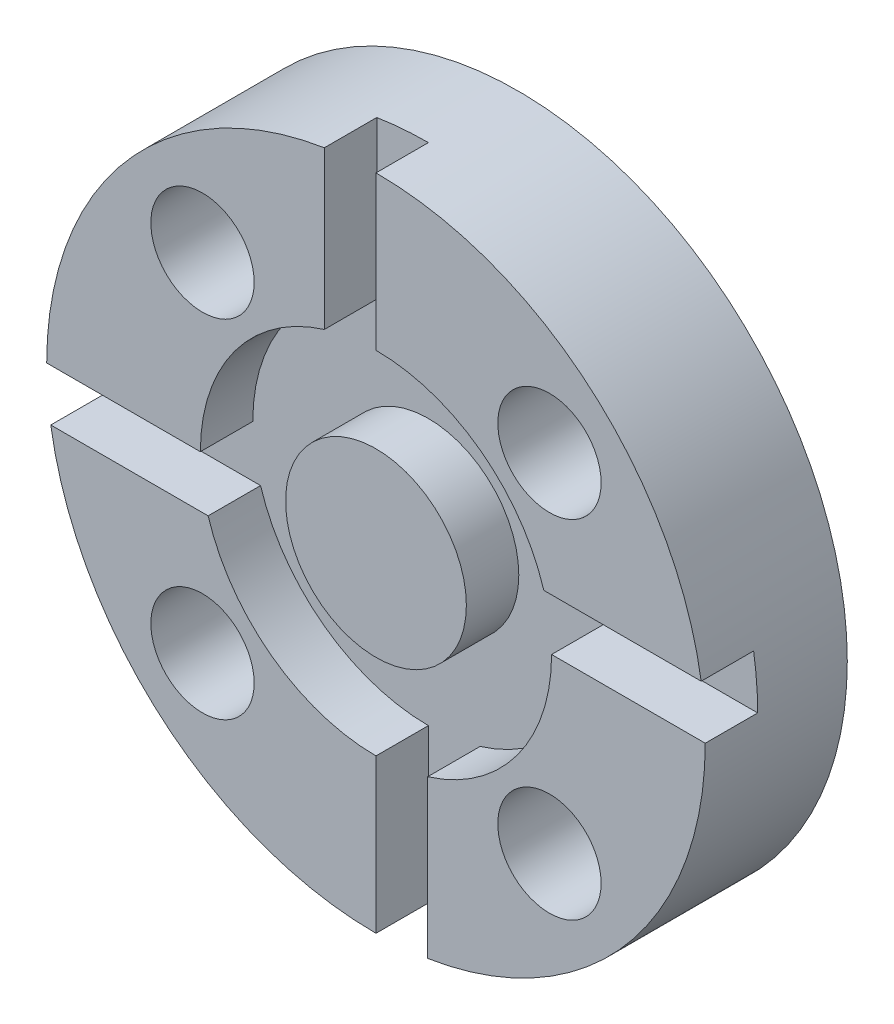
from build123d import *

# Parameters (mm, degrees)
ESQUISSE1_R             = 127.5
ESQUISSE1_R_2           = 20
EXTRUSION1_DEPTH        = 55
ESQUISSE2_R             = 68
ESQUISSE2_R_2           = 35
ENL_V_MAT_EXTRU_1_DEPTH = 20.3
ENL_V_MAT_EXTRU_2_DEPTH = 20.3


with BuildPart() as part:
    # Esquisse1 → Extrusion1 (new body)
    with BuildSketch(Plane.XY):
        Circle(ESQUISSE1_R)
        with Locations((-67.175144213, 67.175144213)):
            Circle(ESQUISSE1_R_2, mode=Mode.SUBTRACT)
        with Locations((67.175144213, 67.175144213)):
            Circle(ESQUISSE1_R_2, mode=Mode.SUBTRACT)
        with Locations((67.175144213, -67.175144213)):
            Circle(ESQUISSE1_R_2, mode=Mode.SUBTRACT)
        with Locations((-67.175144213, -67.175144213)):
            Circle(ESQUISSE1_R_2, mode=Mode.SUBTRACT)
    extrude(amount=EXTRUSION1_DEPTH)

    # Esquisse2 → Enl_v. mat.-Extru.1 (cut)
    with BuildSketch(Plane.XY.offset(55)):
        Circle(ESQUISSE2_R)
        Circle(ESQUISSE2_R_2, mode=Mode.SUBTRACT)
    extrude(amount=-ENL_V_MAT_EXTRU_1_DEPTH, mode=Mode.SUBTRACT)

    # Esquisse3 → Enl_v. mat.-Extru.2 (cut)
    with BuildSketch(Plane.XY.offset(55)):
        with BuildLine():
            Line((-35, 0), (-140, 0))
            Line((-140, 0), (-140, -20))
            Line((-140, -20), (-28.722813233, -20))
            ThreePointArc((-28.722813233, -20), (-33.393850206, -10.480971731), (-35, 0))
        make_face()
        with BuildLine():
            Line((0, -35), (0, -153.993100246))
            Line((0, -153.993100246), (20, -153.993100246))
            Line((20, -153.993100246), (20, -28.722813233))
            ThreePointArc((20, -28.722813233), (10.480971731, -33.393850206), (0, -35))
        make_face()
        with BuildLine():
            Line((35, 0), (138.374000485, 0))
            Line((138.374000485, 0), (138.374000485, 20))
            Line((138.374000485, 20), (28.722813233, 20))
            ThreePointArc((28.722813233, 20), (33.393850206, 10.480971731), (35, 0))
        make_face()
        with BuildLine():
            Line((0, 35), (0, 137.015588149))
            Line((0, 137.015588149), (-20, 137.015588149))
            Line((-20, 137.015588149), (-20, 28.722813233))
            ThreePointArc((-20, 28.722813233), (-10.480971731, 33.393850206), (0, 35))
        make_face()
    extrude(amount=-ENL_V_MAT_EXTRU_2_DEPTH, mode=Mode.SUBTRACT)


solid = part.part
